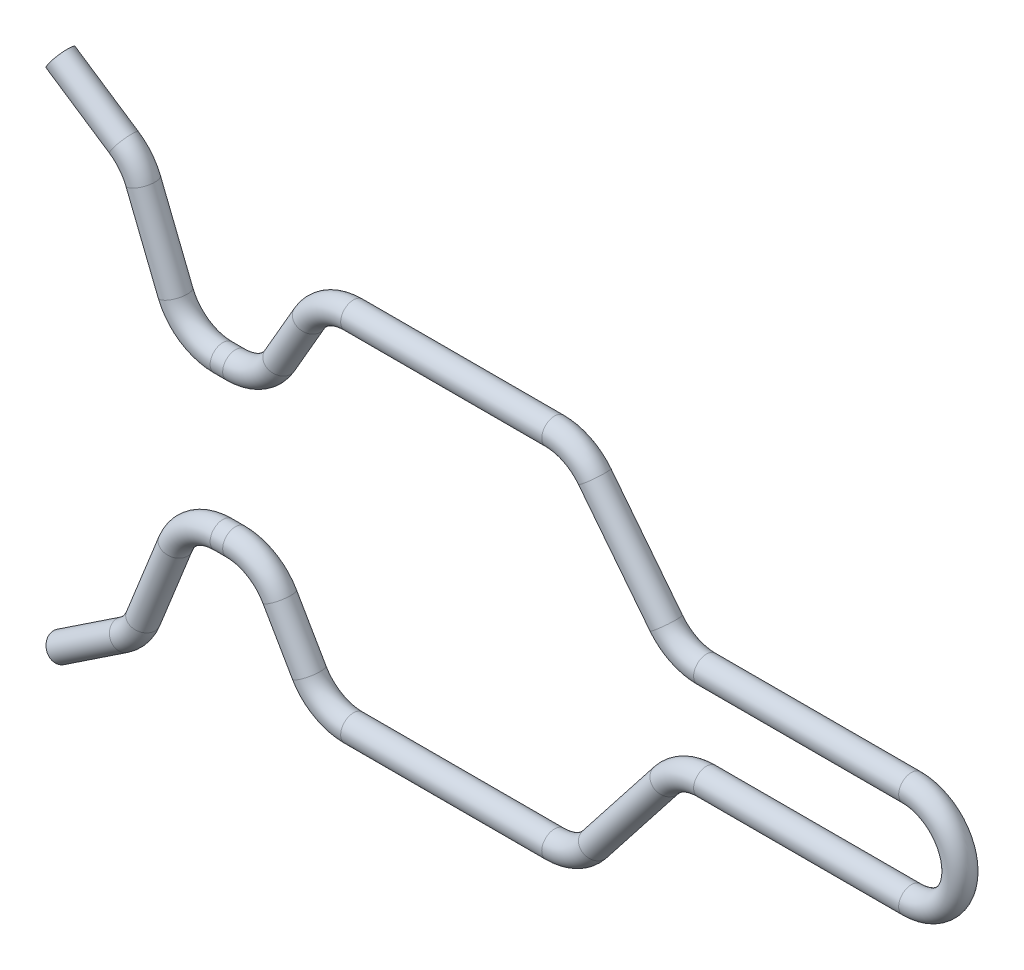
from build123d import *

# Parameters (mm, degrees)
ESQUISSE2_R = 0.5


with BuildPart() as part:
    # Balayage1: sweep along a path in Esquisse1
    with BuildLine(Plane.XY) as balayage1_path:
        Line((-33.309401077, 10), (-30.826253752, 8.34456845))
        ThreePointArc((-30.826253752, 8.34456845), (-30.382585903, 7.940618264), (-30.078700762, 7.423249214))
        Line((-30.078700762, 7.423249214), (-28.812288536, 4.257218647))
        ThreePointArc((-28.812288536, 4.257218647), (-28.076592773, 3.343865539), (-26.955335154, 3))
        Line((-26.955335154, 3), (-26.464101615, 3))
        ThreePointArc((-26.464101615, 3), (-25.464101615, 3.267949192), (-24.732050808, 4))
        Line((-24.732050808, 4), (-23.577350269, 6))
        ThreePointArc((-23.577350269, 6), (-22.845299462, 6.732050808), (-21.845299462, 7))
        Line((-21.845299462, 7), (-13.973142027, 7))
        ThreePointArc((-13.973142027, 7), (-13.098087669, 6.798410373), (-12.399435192, 6.23427987))
        Line((-12.399435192, 6.23427987), (-9.600564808, 2.66572013))
        ThreePointArc((-9.600564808, 2.66572013), (-8.901912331, 2.101589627), (-8.026857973, 1.9))
        Line((-8.026857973, 1.9), (0, 1.9))
        ThreePointArc((0, 1.9), (1.343502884, 1.343502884), (1.9, 0))
    # Esquisse2 → Balayage1 (sweep)
    with BuildSketch(Plane(origin=(0, 0, 0), x_dir=(1, 0, 0), z_dir=(0, 1, 0))):
        with Locations((1.9, 0)):
            Circle(ESQUISSE2_R)
    balayage1 = sweep(path=balayage1_path.line)

    # Sym_trie1: Balayage1 across plane
    add(balayage1.mirror(Plane(origin=(1.9, 0, 0), x_dir=(0, 0, 1), z_dir=(0, 1, 0))))


solid = part.part
